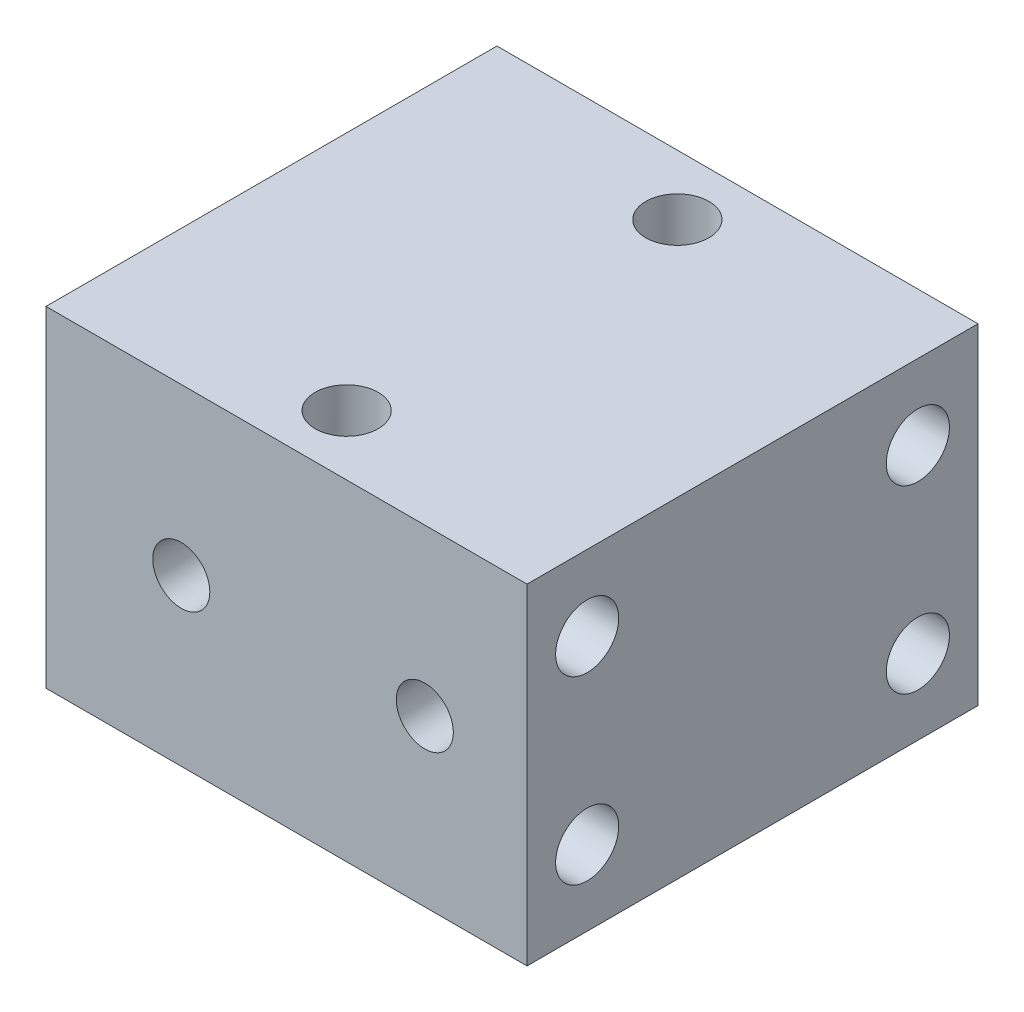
ISO-10303-21;
HEADER;
FILE_DESCRIPTION(('STEP AP214'),'2;1');
FILE_NAME('part.step','',(''),(''),'','','');
FILE_SCHEMA(('AUTOMOTIVE_DESIGN { 1 0 10303 214 1 1 1 1 }'));
ENDSEC;
DATA;
#1=APPLICATION_CONTEXT('core data for automotive mechanical design processes');
#2=APPLICATION_PROTOCOL_DEFINITION('international standard','automotive_design',2000,#1);
#3=PRODUCT_CONTEXT('',#1,'mechanical');
#4=PRODUCT('Part','Part','',(#3));
#5=PRODUCT_RELATED_PRODUCT_CATEGORY('part','',(#4));
#6=PRODUCT_DEFINITION_FORMATION('','',#4);
#7=PRODUCT_DEFINITION_CONTEXT('part definition',#1,'design');
#8=PRODUCT_DEFINITION('design','',#6,#7);
#9=PRODUCT_DEFINITION_SHAPE('','',#8);
#10=(LENGTH_UNIT() NAMED_UNIT(*) SI_UNIT(.MILLI.,.METRE.));
#11=(NAMED_UNIT(*) PLANE_ANGLE_UNIT() SI_UNIT($,.RADIAN.));
#12=(NAMED_UNIT(*) SI_UNIT($,.STERADIAN.) SOLID_ANGLE_UNIT());
#13=UNCERTAINTY_MEASURE_WITH_UNIT(LENGTH_MEASURE(1.E-05),#10,'distance_accuracy_value','');
#14=(GEOMETRIC_REPRESENTATION_CONTEXT(3) GLOBAL_UNCERTAINTY_ASSIGNED_CONTEXT((#13)) GLOBAL_UNIT_ASSIGNED_CONTEXT((#10,
#11,#12)) REPRESENTATION_CONTEXT('',''));
#15=CARTESIAN_POINT('',(0.,0.,0.));
#16=DIRECTION('',(0.,0.,1.));
#17=DIRECTION('',(1.,0.,0.));
#18=AXIS2_PLACEMENT_3D('',#15,#16,#17);
#19=CARTESIAN_POINT('',(0.,55.,27.5));
#20=DIRECTION('',(0.,-1.,0.));
#21=DIRECTION('',(0.,0.,-1.));
#22=AXIS2_PLACEMENT_3D('',#19,#20,#21);
#23=CYLINDRICAL_SURFACE('',#22,5.25);
#24=CARTESIAN_POINT('',(0.,12.5,27.5));
#25=DIRECTION('',(-0.707106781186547,-0.707106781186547,0.));
#26=DIRECTION('',(0.707106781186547,-0.707106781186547,0.));
#27=AXIS2_PLACEMENT_3D('',#24,#25,#26);
#28=ELLIPSE('',#27,7.42462120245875,5.25);
#29=CARTESIAN_POINT('',(0.,12.5,22.25));
#30=VERTEX_POINT('',#29);
#31=CARTESIAN_POINT('',(0.,12.5,32.75));
#32=VERTEX_POINT('',#31);
#33=EDGE_CURVE('E11',#30,#32,#28,.F.);
#34=ORIENTED_EDGE('',*,*,#33,.F.);
#35=CARTESIAN_POINT('',(0.,12.5,27.5));
#36=DIRECTION('',(0.707106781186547,-0.707106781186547,0.));
#37=DIRECTION('',(-0.707106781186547,-0.707106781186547,0.));
#38=AXIS2_PLACEMENT_3D('',#35,#36,#37);
#39=ELLIPSE('',#38,7.42462120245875,5.25);
#40=EDGE_CURVE('E49',#32,#30,#39,.F.);
#41=ORIENTED_EDGE('',*,*,#40,.F.);
#42=EDGE_LOOP('',(#34,#41));
#43=FACE_BOUND('',#42,.T.);
#44=CARTESIAN_POINT('',(0.,42.5,27.5));
#45=DIRECTION('',(-0.707106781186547,-0.707106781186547,0.));
#46=DIRECTION('',(0.707106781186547,-0.707106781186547,0.));
#47=AXIS2_PLACEMENT_3D('',#44,#45,#46);
#48=ELLIPSE('',#47,7.42462120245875,5.25);
#49=CARTESIAN_POINT('',(0.,42.5,22.25));
#50=VERTEX_POINT('',#49);
#51=CARTESIAN_POINT('',(0.,42.5,32.75));
#52=VERTEX_POINT('',#51);
#53=EDGE_CURVE('E250',#50,#52,#48,.T.);
#54=ORIENTED_EDGE('',*,*,#53,.F.);
#55=CARTESIAN_POINT('',(0.,42.5,27.5));
#56=DIRECTION('',(0.707106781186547,-0.707106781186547,0.));
#57=DIRECTION('',(-0.707106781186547,-0.707106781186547,0.));
#58=AXIS2_PLACEMENT_3D('',#55,#56,#57);
#59=ELLIPSE('',#58,7.42462120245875,5.25);
#60=EDGE_CURVE('E248',#52,#50,#59,.T.);
#61=ORIENTED_EDGE('',*,*,#60,.F.);
#62=EDGE_LOOP('',(#54,#61));
#63=FACE_BOUND('',#62,.T.);
#64=ADVANCED_FACE('F33',(#43,#63),#23,.F.);
#65=CARTESIAN_POINT('',(0.,42.5,27.5));
#66=DIRECTION('',(-0.707106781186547,-0.707106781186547,0.));
#67=DIRECTION('',(0.707106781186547,-0.707106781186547,0.));
#68=AXIS2_PLACEMENT_3D('',#65,#66,#67);
#69=ELLIPSE('',#68,7.42462120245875,5.25);
#70=EDGE_CURVE('E110',#50,#52,#69,.F.);
#71=ORIENTED_EDGE('',*,*,#70,.F.);
#72=CARTESIAN_POINT('',(0.,42.5,27.5));
#73=DIRECTION('',(0.707106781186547,-0.707106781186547,0.));
#74=DIRECTION('',(-0.707106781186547,-0.707106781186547,0.));
#75=AXIS2_PLACEMENT_3D('',#72,#73,#74);
#76=ELLIPSE('',#75,7.42462120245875,5.25);
#77=EDGE_CURVE('E56',#52,#50,#76,.F.);
#78=ORIENTED_EDGE('',*,*,#77,.F.);
#79=EDGE_LOOP('',(#71,#78));
#80=FACE_BOUND('',#79,.T.);
#81=CARTESIAN_POINT('',(0.,55.,27.5));
#82=DIRECTION('',(0.,1.,0.));
#83=DIRECTION('',(0.,0.,1.));
#84=AXIS2_PLACEMENT_3D('',#81,#82,#83);
#85=CIRCLE('',#84,5.25);
#86=CARTESIAN_POINT('',(0.,55.,32.75));
#87=VERTEX_POINT('',#86);
#88=EDGE_CURVE('E184',#87,#87,#85,.T.);
#89=ORIENTED_EDGE('',*,*,#88,.T.);
#90=EDGE_LOOP('',(#89));
#91=FACE_BOUND('',#90,.T.);
#92=ADVANCED_FACE('F305',(#80,#91),#23,.F.);
#93=CARTESIAN_POINT('',(0.,55.,-27.5));
#94=DIRECTION('',(0.,-1.,0.));
#95=DIRECTION('',(0.,0.,-1.));
#96=AXIS2_PLACEMENT_3D('',#93,#94,#95);
#97=CYLINDRICAL_SURFACE('',#96,5.25);
#98=CARTESIAN_POINT('',(0.,12.5,-27.5));
#99=DIRECTION('',(-0.707106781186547,-0.707106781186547,0.));
#100=DIRECTION('',(0.707106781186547,-0.707106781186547,0.));
#101=AXIS2_PLACEMENT_3D('',#98,#99,#100);
#102=ELLIPSE('',#101,7.42462120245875,5.25);
#103=CARTESIAN_POINT('',(0.,12.5,-32.75));
#104=VERTEX_POINT('',#103);
#105=CARTESIAN_POINT('',(0.,12.5,-22.25));
#106=VERTEX_POINT('',#105);
#107=EDGE_CURVE('E244',#104,#106,#102,.F.);
#108=ORIENTED_EDGE('',*,*,#107,.F.);
#109=CARTESIAN_POINT('',(0.,12.5,-27.5));
#110=DIRECTION('',(0.707106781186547,-0.707106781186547,0.));
#111=DIRECTION('',(-0.707106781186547,-0.707106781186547,0.));
#112=AXIS2_PLACEMENT_3D('',#109,#110,#111);
#113=ELLIPSE('',#112,7.42462120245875,5.25);
#114=EDGE_CURVE('E236',#106,#104,#113,.F.);
#115=ORIENTED_EDGE('',*,*,#114,.F.);
#116=EDGE_LOOP('',(#108,#115));
#117=FACE_BOUND('',#116,.T.);
#118=CARTESIAN_POINT('',(0.,42.5,-27.5));
#119=DIRECTION('',(-0.707106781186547,-0.707106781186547,0.));
#120=DIRECTION('',(0.707106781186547,-0.707106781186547,0.));
#121=AXIS2_PLACEMENT_3D('',#118,#119,#120);
#122=ELLIPSE('',#121,7.42462120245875,5.25);
#123=CARTESIAN_POINT('',(0.,42.5,-32.75));
#124=VERTEX_POINT('',#123);
#125=CARTESIAN_POINT('',(0.,42.5,-22.25));
#126=VERTEX_POINT('',#125);
#127=EDGE_CURVE('E230',#124,#126,#122,.T.);
#128=ORIENTED_EDGE('',*,*,#127,.F.);
#129=CARTESIAN_POINT('',(0.,42.5,-27.5));
#130=DIRECTION('',(0.707106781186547,-0.707106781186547,0.));
#131=DIRECTION('',(-0.707106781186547,-0.707106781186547,0.));
#132=AXIS2_PLACEMENT_3D('',#129,#130,#131);
#133=ELLIPSE('',#132,7.42462120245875,5.25);
#134=EDGE_CURVE('E228',#126,#124,#133,.T.);
#135=ORIENTED_EDGE('',*,*,#134,.F.);
#136=EDGE_LOOP('',(#128,#135));
#137=FACE_BOUND('',#136,.T.);
#138=ADVANCED_FACE('F310',(#117,#137),#97,.F.);
#139=CARTESIAN_POINT('',(0.,42.5,-27.5));
#140=DIRECTION('',(-0.707106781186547,-0.707106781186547,0.));
#141=DIRECTION('',(0.707106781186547,-0.707106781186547,0.));
#142=AXIS2_PLACEMENT_3D('',#139,#140,#141);
#143=ELLIPSE('',#142,7.42462120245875,5.25);
#144=EDGE_CURVE('E233',#124,#126,#143,.F.);
#145=ORIENTED_EDGE('',*,*,#144,.F.);
#146=CARTESIAN_POINT('',(0.,42.5,-27.5));
#147=DIRECTION('',(0.707106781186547,-0.707106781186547,0.));
#148=DIRECTION('',(-0.707106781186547,-0.707106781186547,0.));
#149=AXIS2_PLACEMENT_3D('',#146,#147,#148);
#150=ELLIPSE('',#149,7.42462120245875,5.25);
#151=EDGE_CURVE('E225',#126,#124,#150,.F.);
#152=ORIENTED_EDGE('',*,*,#151,.F.);
#153=EDGE_LOOP('',(#145,#152));
#154=FACE_BOUND('',#153,.T.);
#155=CARTESIAN_POINT('',(0.,55.,-27.5));
#156=DIRECTION('',(0.,1.,0.));
#157=DIRECTION('',(0.,0.,1.));
#158=AXIS2_PLACEMENT_3D('',#155,#156,#157);
#159=CIRCLE('',#158,5.25);
#160=CARTESIAN_POINT('',(0.,55.,-22.25));
#161=VERTEX_POINT('',#160);
#162=EDGE_CURVE('E190',#161,#161,#159,.T.);
#163=ORIENTED_EDGE('',*,*,#162,.T.);
#164=EDGE_LOOP('',(#163));
#165=FACE_BOUND('',#164,.T.);
#166=ADVANCED_FACE('F323',(#154,#165),#97,.F.);
#167=CARTESIAN_POINT('',(-40.,55.,37.5));
#168=DIRECTION('',(0.,1.,0.));
#169=DIRECTION('',(0.,0.,1.));
#170=AXIS2_PLACEMENT_3D('',#167,#168,#169);
#171=PLANE('',#170);
#172=ORIENTED_EDGE('',*,*,#162,.F.);
#173=EDGE_LOOP('',(#172));
#174=FACE_BOUND('',#173,.T.);
#175=DIRECTION('',(0.,0.,1.));
#176=VECTOR('',#175,1.);
#177=CARTESIAN_POINT('',(-40.,55.,-37.5));
#178=LINE('',#177,#176);
#179=CARTESIAN_POINT('',(-40.,55.,-37.5));
#180=VERTEX_POINT('',#179);
#181=CARTESIAN_POINT('',(-40.,55.,37.5));
#182=VERTEX_POINT('',#181);
#183=EDGE_CURVE('E196',#180,#182,#178,.T.);
#184=ORIENTED_EDGE('',*,*,#183,.T.);
#185=DIRECTION('',(1.,0.,0.));
#186=VECTOR('',#185,1.);
#187=CARTESIAN_POINT('',(-40.,55.,37.5));
#188=LINE('',#187,#186);
#189=CARTESIAN_POINT('',(40.,55.,37.5));
#190=VERTEX_POINT('',#189);
#191=EDGE_CURVE('E199',#182,#190,#188,.T.);
#192=ORIENTED_EDGE('',*,*,#191,.T.);
#193=DIRECTION('',(0.,0.,-1.));
#194=VECTOR('',#193,1.);
#195=CARTESIAN_POINT('',(40.,55.,-37.5));
#196=LINE('',#195,#194);
#197=CARTESIAN_POINT('',(40.,55.,-37.5));
#198=VERTEX_POINT('',#197);
#199=EDGE_CURVE('E202',#190,#198,#196,.T.);
#200=ORIENTED_EDGE('',*,*,#199,.T.);
#201=DIRECTION('',(-1.,0.,0.));
#202=VECTOR('',#201,1.);
#203=CARTESIAN_POINT('',(-40.,55.,-37.5));
#204=LINE('',#203,#202);
#205=EDGE_CURVE('E204',#198,#180,#204,.T.);
#206=ORIENTED_EDGE('',*,*,#205,.T.);
#207=EDGE_LOOP('',(#184,#192,#200,#206));
#208=FACE_BOUND('',#207,.T.);
#209=ORIENTED_EDGE('',*,*,#88,.F.);
#210=EDGE_LOOP('',(#209));
#211=FACE_BOUND('',#210,.T.);
#212=ADVANCED_FACE('F293',(#174,#208,#211),#171,.T.);
#213=CARTESIAN_POINT('',(-40.,0.,37.5));
#214=DIRECTION('',(0.,1.,0.));
#215=DIRECTION('',(0.,0.,1.));
#216=AXIS2_PLACEMENT_3D('',#213,#214,#215);
#217=PLANE('',#216);
#218=CARTESIAN_POINT('',(0.,0.,-27.5));
#219=DIRECTION('',(0.,1.,0.));
#220=DIRECTION('',(0.,0.,1.));
#221=AXIS2_PLACEMENT_3D('',#218,#219,#220);
#222=CIRCLE('',#221,5.25);
#223=CARTESIAN_POINT('',(0.,0.,-22.25));
#224=VERTEX_POINT('',#223);
#225=EDGE_CURVE('E187',#224,#224,#222,.T.);
#226=ORIENTED_EDGE('',*,*,#225,.T.);
#227=EDGE_LOOP('',(#226));
#228=FACE_BOUND('',#227,.T.);
#229=DIRECTION('',(0.,0.,1.));
#230=VECTOR('',#229,1.);
#231=CARTESIAN_POINT('',(-40.,0.,-37.5));
#232=LINE('',#231,#230);
#233=CARTESIAN_POINT('',(-40.,0.,-37.5));
#234=VERTEX_POINT('',#233);
#235=CARTESIAN_POINT('',(-40.,0.,37.5));
#236=VERTEX_POINT('',#235);
#237=EDGE_CURVE('E193',#234,#236,#232,.T.);
#238=ORIENTED_EDGE('',*,*,#237,.F.);
#239=DIRECTION('',(-1.,0.,0.));
#240=VECTOR('',#239,1.);
#241=CARTESIAN_POINT('',(-40.,0.,-37.5));
#242=LINE('',#241,#240);
#243=CARTESIAN_POINT('',(40.,0.,-37.5));
#244=VERTEX_POINT('',#243);
#245=EDGE_CURVE('E200',#244,#234,#242,.T.);
#246=ORIENTED_EDGE('',*,*,#245,.F.);
#247=DIRECTION('',(0.,0.,-1.));
#248=VECTOR('',#247,1.);
#249=CARTESIAN_POINT('',(40.,0.,-37.5));
#250=LINE('',#249,#248);
#251=CARTESIAN_POINT('',(40.,0.,37.5));
#252=VERTEX_POINT('',#251);
#253=EDGE_CURVE('E211',#252,#244,#250,.T.);
#254=ORIENTED_EDGE('',*,*,#253,.F.);
#255=DIRECTION('',(1.,0.,0.));
#256=VECTOR('',#255,1.);
#257=CARTESIAN_POINT('',(-40.,0.,37.5));
#258=LINE('',#257,#256);
#259=EDGE_CURVE('E209',#236,#252,#258,.T.);
#260=ORIENTED_EDGE('',*,*,#259,.F.);
#261=EDGE_LOOP('',(#238,#246,#254,#260));
#262=FACE_BOUND('',#261,.T.);
#263=CARTESIAN_POINT('',(0.,0.,27.5));
#264=DIRECTION('',(0.,1.,0.));
#265=DIRECTION('',(0.,0.,1.));
#266=AXIS2_PLACEMENT_3D('',#263,#264,#265);
#267=CIRCLE('',#266,5.25);
#268=CARTESIAN_POINT('',(0.,0.,32.75));
#269=VERTEX_POINT('',#268);
#270=EDGE_CURVE('E181',#269,#269,#267,.T.);
#271=ORIENTED_EDGE('',*,*,#270,.T.);
#272=EDGE_LOOP('',(#271));
#273=FACE_BOUND('',#272,.T.);
#274=ADVANCED_FACE('F287',(#228,#262,#273),#217,.F.);
#275=CARTESIAN_POINT('',(-40.,55.,-37.5));
#276=DIRECTION('',(1.,0.,0.));
#277=DIRECTION('',(0.,0.,-1.));
#278=AXIS2_PLACEMENT_3D('',#275,#276,#277);
#279=PLANE('',#278);
#280=CARTESIAN_POINT('',(-40.,12.5,27.5));
#281=DIRECTION('',(-1.,0.,0.));
#282=DIRECTION('',(0.,0.,1.));
#283=AXIS2_PLACEMENT_3D('',#280,#281,#282);
#284=CIRCLE('',#283,5.25);
#285=CARTESIAN_POINT('',(-40.,12.5,32.75));
#286=VERTEX_POINT('',#285);
#287=EDGE_CURVE('E118',#286,#286,#284,.T.);
#288=ORIENTED_EDGE('',*,*,#287,.F.);
#289=EDGE_LOOP('',(#288));
#290=FACE_BOUND('',#289,.T.);
#291=CARTESIAN_POINT('',(-40.,42.5,27.5));
#292=DIRECTION('',(-1.,0.,0.));
#293=DIRECTION('',(0.,0.,1.));
#294=AXIS2_PLACEMENT_3D('',#291,#292,#293);
#295=CIRCLE('',#294,5.25);
#296=CARTESIAN_POINT('',(-40.,42.5,32.75));
#297=VERTEX_POINT('',#296);
#298=EDGE_CURVE('E135',#297,#297,#295,.T.);
#299=ORIENTED_EDGE('',*,*,#298,.F.);
#300=EDGE_LOOP('',(#299));
#301=FACE_BOUND('',#300,.T.);
#302=CARTESIAN_POINT('',(-40.,12.5,-27.5));
#303=DIRECTION('',(-1.,0.,0.));
#304=DIRECTION('',(0.,0.,1.));
#305=AXIS2_PLACEMENT_3D('',#302,#303,#304);
#306=CIRCLE('',#305,5.25);
#307=CARTESIAN_POINT('',(-40.,12.5,-22.25));
#308=VERTEX_POINT('',#307);
#309=EDGE_CURVE('E141',#308,#308,#306,.T.);
#310=ORIENTED_EDGE('',*,*,#309,.F.);
#311=EDGE_LOOP('',(#310));
#312=FACE_BOUND('',#311,.T.);
#313=CARTESIAN_POINT('',(-40.,42.5,-27.5));
#314=DIRECTION('',(-1.,0.,0.));
#315=DIRECTION('',(0.,0.,1.));
#316=AXIS2_PLACEMENT_3D('',#313,#314,#315);
#317=CIRCLE('',#316,5.25);
#318=CARTESIAN_POINT('',(-40.,42.5,-22.25));
#319=VERTEX_POINT('',#318);
#320=EDGE_CURVE('E147',#319,#319,#317,.T.);
#321=ORIENTED_EDGE('',*,*,#320,.F.);
#322=EDGE_LOOP('',(#321));
#323=FACE_BOUND('',#322,.T.);
#324=CARTESIAN_POINT('',(-40.,27.5,0.));
#325=DIRECTION('',(-1.,0.,0.));
#326=DIRECTION('',(0.,0.,1.));
#327=AXIS2_PLACEMENT_3D('',#324,#325,#326);
#328=CIRCLE('',#327,0.5);
#329=CARTESIAN_POINT('',(-40.,27.5,0.5));
#330=VERTEX_POINT('',#329);
#331=EDGE_CURVE('E177',#330,#330,#328,.T.);
#332=ORIENTED_EDGE('',*,*,#331,.F.);
#333=EDGE_LOOP('',(#332));
#334=FACE_BOUND('',#333,.T.);
#335=ORIENTED_EDGE('',*,*,#237,.T.);
#336=DIRECTION('',(0.,-1.,0.));
#337=VECTOR('',#336,1.);
#338=CARTESIAN_POINT('',(-40.,55.,37.5));
#339=LINE('',#338,#337);
#340=EDGE_CURVE('E222',#182,#236,#339,.T.);
#341=ORIENTED_EDGE('',*,*,#340,.F.);
#342=ORIENTED_EDGE('',*,*,#183,.F.);
#343=DIRECTION('',(0.,-1.,0.));
#344=VECTOR('',#343,1.);
#345=CARTESIAN_POINT('',(-40.,55.,-37.5));
#346=LINE('',#345,#344);
#347=EDGE_CURVE('E206',#180,#234,#346,.T.);
#348=ORIENTED_EDGE('',*,*,#347,.T.);
#349=EDGE_LOOP('',(#335,#341,#342,#348));
#350=FACE_BOUND('',#349,.T.);
#351=ADVANCED_FACE('F35',(#290,#301,#312,#323,#334,#350),#279,.F.);
#352=CARTESIAN_POINT('',(-40.,55.,37.5));
#353=DIRECTION('',(0.,0.,-1.));
#354=DIRECTION('',(-1.,0.,0.));
#355=AXIS2_PLACEMENT_3D('',#352,#353,#354);
#356=PLANE('',#355);
#357=CARTESIAN_POINT('',(23.,27.5,37.5));
#358=DIRECTION('',(0.,0.,1.));
#359=DIRECTION('',(1.,0.,0.));
#360=AXIS2_PLACEMENT_3D('',#357,#358,#359);
#361=CIRCLE('',#360,4.744593);
#362=CARTESIAN_POINT('',(27.744593,27.5,37.5));
#363=VERTEX_POINT('',#362);
#364=EDGE_CURVE('E153',#363,#363,#361,.T.);
#365=ORIENTED_EDGE('',*,*,#364,.F.);
#366=EDGE_LOOP('',(#365));
#367=FACE_BOUND('',#366,.T.);
#368=CARTESIAN_POINT('',(-17.5,27.5,37.5));
#369=DIRECTION('',(0.,0.,1.));
#370=DIRECTION('',(1.,0.,0.));
#371=AXIS2_PLACEMENT_3D('',#368,#369,#370);
#372=CIRCLE('',#371,4.744593);
#373=CARTESIAN_POINT('',(-12.755407,27.5,37.5));
#374=VERTEX_POINT('',#373);
#375=EDGE_CURVE('E165',#374,#374,#372,.T.);
#376=ORIENTED_EDGE('',*,*,#375,.F.);
#377=EDGE_LOOP('',(#376));
#378=FACE_BOUND('',#377,.T.);
#379=ORIENTED_EDGE('',*,*,#259,.T.);
#380=DIRECTION('',(0.,-1.,0.));
#381=VECTOR('',#380,1.);
#382=CARTESIAN_POINT('',(40.,55.,37.5));
#383=LINE('',#382,#381);
#384=EDGE_CURVE('E219',#190,#252,#383,.T.);
#385=ORIENTED_EDGE('',*,*,#384,.F.);
#386=ORIENTED_EDGE('',*,*,#191,.F.);
#387=ORIENTED_EDGE('',*,*,#340,.T.);
#388=EDGE_LOOP('',(#379,#385,#386,#387));
#389=FACE_BOUND('',#388,.T.);
#390=ADVANCED_FACE('F270',(#367,#378,#389),#356,.F.);
#391=CARTESIAN_POINT('',(40.,55.,-37.5));
#392=DIRECTION('',(-1.,0.,0.));
#393=DIRECTION('',(0.,0.,1.));
#394=AXIS2_PLACEMENT_3D('',#391,#392,#393);
#395=PLANE('',#394);
#396=CARTESIAN_POINT('',(40.,12.5,27.5));
#397=DIRECTION('',(-1.,0.,0.));
#398=DIRECTION('',(0.,0.,1.));
#399=AXIS2_PLACEMENT_3D('',#396,#397,#398);
#400=CIRCLE('',#399,5.25);
#401=CARTESIAN_POINT('',(40.,12.5,32.75));
#402=VERTEX_POINT('',#401);
#403=EDGE_CURVE('E123',#402,#402,#400,.F.);
#404=ORIENTED_EDGE('',*,*,#403,.F.);
#405=EDGE_LOOP('',(#404));
#406=FACE_BOUND('',#405,.T.);
#407=CARTESIAN_POINT('',(40.,42.5,27.5));
#408=DIRECTION('',(-1.,0.,0.));
#409=DIRECTION('',(0.,0.,1.));
#410=AXIS2_PLACEMENT_3D('',#407,#408,#409);
#411=CIRCLE('',#410,5.25);
#412=CARTESIAN_POINT('',(40.,42.5,32.75));
#413=VERTEX_POINT('',#412);
#414=EDGE_CURVE('E138',#413,#413,#411,.F.);
#415=ORIENTED_EDGE('',*,*,#414,.F.);
#416=EDGE_LOOP('',(#415));
#417=FACE_BOUND('',#416,.T.);
#418=CARTESIAN_POINT('',(40.,12.5,-27.5));
#419=DIRECTION('',(-1.,0.,0.));
#420=DIRECTION('',(0.,0.,1.));
#421=AXIS2_PLACEMENT_3D('',#418,#419,#420);
#422=CIRCLE('',#421,5.25);
#423=CARTESIAN_POINT('',(40.,12.5,-22.25));
#424=VERTEX_POINT('',#423);
#425=EDGE_CURVE('E144',#424,#424,#422,.F.);
#426=ORIENTED_EDGE('',*,*,#425,.F.);
#427=EDGE_LOOP('',(#426));
#428=FACE_BOUND('',#427,.T.);
#429=CARTESIAN_POINT('',(40.,42.5,-27.5));
#430=DIRECTION('',(-1.,0.,0.));
#431=DIRECTION('',(0.,0.,1.));
#432=AXIS2_PLACEMENT_3D('',#429,#430,#431);
#433=CIRCLE('',#432,5.25);
#434=CARTESIAN_POINT('',(40.,42.5,-22.25));
#435=VERTEX_POINT('',#434);
#436=EDGE_CURVE('E150',#435,#435,#433,.F.);
#437=ORIENTED_EDGE('',*,*,#436,.F.);
#438=EDGE_LOOP('',(#437));
#439=FACE_BOUND('',#438,.T.);
#440=ORIENTED_EDGE('',*,*,#253,.T.);
#441=DIRECTION('',(0.,-1.,0.));
#442=VECTOR('',#441,1.);
#443=CARTESIAN_POINT('',(40.,55.,-37.5));
#444=LINE('',#443,#442);
#445=EDGE_CURVE('E216',#198,#244,#444,.T.);
#446=ORIENTED_EDGE('',*,*,#445,.F.);
#447=ORIENTED_EDGE('',*,*,#199,.F.);
#448=ORIENTED_EDGE('',*,*,#384,.T.);
#449=EDGE_LOOP('',(#440,#446,#447,#448));
#450=FACE_BOUND('',#449,.T.);
#451=ADVANCED_FACE('F266',(#406,#417,#428,#439,#450),#395,.F.);
#452=CARTESIAN_POINT('',(-40.,55.,-37.5));
#453=DIRECTION('',(0.,0.,1.));
#454=DIRECTION('',(1.,0.,0.));
#455=AXIS2_PLACEMENT_3D('',#452,#453,#454);
#456=PLANE('',#455);
#457=ORIENTED_EDGE('',*,*,#245,.T.);
#458=ORIENTED_EDGE('',*,*,#347,.F.);
#459=ORIENTED_EDGE('',*,*,#205,.F.);
#460=ORIENTED_EDGE('',*,*,#445,.T.);
#461=EDGE_LOOP('',(#457,#458,#459,#460));
#462=FACE_BOUND('',#461,.T.);
#463=ADVANCED_FACE('F269',(#462),#456,.F.);
#464=CARTESIAN_POINT('',(0.,12.5,-27.5));
#465=DIRECTION('',(-0.707106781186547,-0.707106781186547,0.));
#466=DIRECTION('',(0.707106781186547,-0.707106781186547,0.));
#467=AXIS2_PLACEMENT_3D('',#464,#465,#466);
#468=ELLIPSE('',#467,7.42462120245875,5.25);
#469=EDGE_CURVE('E241',#104,#106,#468,.T.);
#470=ORIENTED_EDGE('',*,*,#469,.F.);
#471=CARTESIAN_POINT('',(0.,12.5,-27.5));
#472=DIRECTION('',(0.707106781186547,-0.707106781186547,0.));
#473=DIRECTION('',(-0.707106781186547,-0.707106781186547,0.));
#474=AXIS2_PLACEMENT_3D('',#471,#472,#473);
#475=ELLIPSE('',#474,7.42462120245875,5.25);
#476=EDGE_CURVE('E239',#106,#104,#475,.T.);
#477=ORIENTED_EDGE('',*,*,#476,.F.);
#478=EDGE_LOOP('',(#470,#477));
#479=FACE_BOUND('',#478,.T.);
#480=ORIENTED_EDGE('',*,*,#225,.F.);
#481=EDGE_LOOP('',(#480));
#482=FACE_BOUND('',#481,.T.);
#483=ADVANCED_FACE('F315',(#479,#482),#97,.F.);
#484=CARTESIAN_POINT('',(0.,12.5,27.5));
#485=DIRECTION('',(-0.707106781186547,-0.707106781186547,0.));
#486=DIRECTION('',(0.707106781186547,-0.707106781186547,0.));
#487=AXIS2_PLACEMENT_3D('',#484,#485,#486);
#488=ELLIPSE('',#487,7.42462120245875,5.25);
#489=EDGE_CURVE('E42',#30,#32,#488,.T.);
#490=ORIENTED_EDGE('',*,*,#489,.F.);
#491=CARTESIAN_POINT('',(0.,12.5,27.5));
#492=DIRECTION('',(0.707106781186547,-0.707106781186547,0.));
#493=DIRECTION('',(-0.707106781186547,-0.707106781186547,0.));
#494=AXIS2_PLACEMENT_3D('',#491,#492,#493);
#495=ELLIPSE('',#494,7.42462120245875,5.25);
#496=EDGE_CURVE('E101',#32,#30,#495,.T.);
#497=ORIENTED_EDGE('',*,*,#496,.F.);
#498=EDGE_LOOP('',(#490,#497));
#499=FACE_BOUND('',#498,.T.);
#500=ORIENTED_EDGE('',*,*,#270,.F.);
#501=EDGE_LOOP('',(#500));
#502=FACE_BOUND('',#501,.T.);
#503=ADVANCED_FACE('F113',(#499,#502),#23,.F.);
#504=CARTESIAN_POINT('',(20.,27.5,0.));
#505=DIRECTION('',(-1.,0.,0.));
#506=DIRECTION('',(0.,0.,1.));
#507=AXIS2_PLACEMENT_3D('',#504,#505,#506);
#508=CYLINDRICAL_SURFACE('',#507,0.5);
#509=CARTESIAN_POINT('',(20.,27.5,0.));
#510=DIRECTION('',(-1.,0.,0.));
#511=DIRECTION('',(0.,0.,1.));
#512=AXIS2_PLACEMENT_3D('',#509,#510,#511);
#513=CIRCLE('',#512,0.5);
#514=CARTESIAN_POINT('',(20.,27.5,0.499999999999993));
#515=VERTEX_POINT('',#514);
#516=EDGE_CURVE('E178',#515,#515,#513,.T.);
#517=ORIENTED_EDGE('',*,*,#516,.F.);
#518=EDGE_LOOP('',(#517));
#519=FACE_BOUND('',#518,.T.);
#520=ORIENTED_EDGE('',*,*,#331,.T.);
#521=EDGE_LOOP('',(#520));
#522=FACE_BOUND('',#521,.T.);
#523=ADVANCED_FACE('F314',(#519,#522),#508,.F.);
#524=CARTESIAN_POINT('',(20.,27.5,0.));
#525=DIRECTION('',(-1.,0.,0.));
#526=DIRECTION('',(0.,0.,1.));
#527=AXIS2_PLACEMENT_3D('',#524,#525,#526);
#528=PLANE('',#527);
#529=ORIENTED_EDGE('',*,*,#516,.T.);
#530=EDGE_LOOP('',(#529));
#531=FACE_BOUND('',#530,.T.);
#532=ADVANCED_FACE('F320',(#531),#528,.T.);
#533=CARTESIAN_POINT('',(-17.5,27.5,25.88));
#534=DIRECTION('',(0.,0.,1.));
#535=DIRECTION('',(1.,0.,0.));
#536=AXIS2_PLACEMENT_3D('',#533,#534,#535);
#537=CONICAL_SURFACE('',#536,4.21640000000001,1.02974425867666);
#538=CARTESIAN_POINT('',(-17.5,27.5,24.5482525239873));
#539=DIRECTION('',(0.,0.,1.));
#540=DIRECTION('',(1.,0.,0.));
#541=AXIS2_PLACEMENT_3D('',#538,#539,#540);
#542=CIRCLE('',#541,2.00000000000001);
#543=CARTESIAN_POINT('',(-15.5,27.5,24.5482525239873));
#544=VERTEX_POINT('',#543);
#545=EDGE_CURVE('E116',#544,#544,#542,.F.);
#546=ORIENTED_EDGE('',*,*,#545,.T.);
#547=EDGE_LOOP('',(#546));
#548=FACE_BOUND('',#547,.T.);
#549=CARTESIAN_POINT('',(-17.5,27.5,25.88));
#550=DIRECTION('',(0.,0.,1.));
#551=DIRECTION('',(1.,0.,0.));
#552=AXIS2_PLACEMENT_3D('',#549,#550,#551);
#553=CIRCLE('',#552,4.21640000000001);
#554=CARTESIAN_POINT('',(-13.2836,27.5,25.88));
#555=VERTEX_POINT('',#554);
#556=EDGE_CURVE('E174',#555,#555,#553,.T.);
#557=ORIENTED_EDGE('',*,*,#556,.T.);
#558=EDGE_LOOP('',(#557));
#559=FACE_BOUND('',#558,.T.);
#560=ADVANCED_FACE('F385',(#548,#559),#537,.F.);
#561=CARTESIAN_POINT('',(-17.5,27.5,37.5));
#562=DIRECTION('',(0.,0.,1.));
#563=DIRECTION('',(1.,0.,0.));
#564=AXIS2_PLACEMENT_3D('',#561,#562,#563);
#565=CYLINDRICAL_SURFACE('',#564,4.21640000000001);
#566=ORIENTED_EDGE('',*,*,#556,.F.);
#567=EDGE_LOOP('',(#566));
#568=FACE_BOUND('',#567,.T.);
#569=CARTESIAN_POINT('',(-17.5,27.5,30.58));
#570=DIRECTION('',(0.,0.,1.));
#571=DIRECTION('',(1.,0.,0.));
#572=AXIS2_PLACEMENT_3D('',#569,#570,#571);
#573=CIRCLE('',#572,4.2164);
#574=CARTESIAN_POINT('',(-13.2836,27.5,30.58));
#575=VERTEX_POINT('',#574);
#576=EDGE_CURVE('E171',#575,#575,#573,.T.);
#577=ORIENTED_EDGE('',*,*,#576,.T.);
#578=EDGE_LOOP('',(#577));
#579=FACE_BOUND('',#578,.T.);
#580=ADVANCED_FACE('F381',(#568,#579),#565,.F.);
#581=CARTESIAN_POINT('',(-13.2836,27.5,30.58));
#582=DIRECTION('',(0.,0.,-1.));
#583=DIRECTION('',(-1.,0.,0.));
#584=AXIS2_PLACEMENT_3D('',#581,#582,#583);
#585=PLANE('',#584);
#586=ORIENTED_EDGE('',*,*,#576,.F.);
#587=EDGE_LOOP('',(#586));
#588=FACE_BOUND('',#587,.T.);
#589=CARTESIAN_POINT('',(-17.5,27.5,30.58));
#590=DIRECTION('',(0.,0.,1.));
#591=DIRECTION('',(1.,0.,0.));
#592=AXIS2_PLACEMENT_3D('',#589,#590,#591);
#593=CIRCLE('',#592,4.53739893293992);
#594=CARTESIAN_POINT('',(-12.9626010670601,27.5,30.58));
#595=VERTEX_POINT('',#594);
#596=EDGE_CURVE('E168',#595,#595,#593,.T.);
#597=ORIENTED_EDGE('',*,*,#596,.T.);
#598=EDGE_LOOP('',(#597));
#599=FACE_BOUND('',#598,.T.);
#600=ADVANCED_FACE('F377',(#588,#599),#585,.F.);
#601=CARTESIAN_POINT('',(-17.5,27.5,37.5));
#602=DIRECTION('',(0.,0.,1.));
#603=DIRECTION('',(1.,0.,0.));
#604=AXIS2_PLACEMENT_3D('',#601,#602,#603);
#605=CONICAL_SURFACE('',#604,4.744593,0.0299323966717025);
#606=ORIENTED_EDGE('',*,*,#596,.F.);
#607=EDGE_LOOP('',(#606));
#608=FACE_BOUND('',#607,.T.);
#609=ORIENTED_EDGE('',*,*,#375,.T.);
#610=EDGE_LOOP('',(#609));
#611=FACE_BOUND('',#610,.T.);
#612=ADVANCED_FACE('F373',(#608,#611),#605,.F.);
#613=CARTESIAN_POINT('',(23.,27.5,25.88));
#614=DIRECTION('',(0.,0.,1.));
#615=DIRECTION('',(1.,0.,0.));
#616=AXIS2_PLACEMENT_3D('',#613,#614,#615);
#617=CONICAL_SURFACE('',#616,4.21640000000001,1.02974425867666);
#618=CARTESIAN_POINT('',(23.,27.5,24.5482525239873));
#619=DIRECTION('',(0.,0.,1.));
#620=DIRECTION('',(1.,0.,0.));
#621=AXIS2_PLACEMENT_3D('',#618,#619,#620);
#622=CIRCLE('',#621,2.);
#623=CARTESIAN_POINT('',(25.,27.5,24.5482525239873));
#624=VERTEX_POINT('',#623);
#625=EDGE_CURVE('E37',#624,#624,#622,.F.);
#626=ORIENTED_EDGE('',*,*,#625,.T.);
#627=EDGE_LOOP('',(#626));
#628=FACE_BOUND('',#627,.T.);
#629=CARTESIAN_POINT('',(23.,27.5,25.88));
#630=DIRECTION('',(0.,0.,1.));
#631=DIRECTION('',(1.,0.,0.));
#632=AXIS2_PLACEMENT_3D('',#629,#630,#631);
#633=CIRCLE('',#632,4.21640000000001);
#634=CARTESIAN_POINT('',(27.2164,27.5,25.88));
#635=VERTEX_POINT('',#634);
#636=EDGE_CURVE('E162',#635,#635,#633,.T.);
#637=ORIENTED_EDGE('',*,*,#636,.T.);
#638=EDGE_LOOP('',(#637));
#639=FACE_BOUND('',#638,.T.);
#640=ADVANCED_FACE('F369',(#628,#639),#617,.F.);
#641=CARTESIAN_POINT('',(23.,27.5,37.5));
#642=DIRECTION('',(0.,0.,1.));
#643=DIRECTION('',(1.,0.,0.));
#644=AXIS2_PLACEMENT_3D('',#641,#642,#643);
#645=CYLINDRICAL_SURFACE('',#644,4.21640000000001);
#646=ORIENTED_EDGE('',*,*,#636,.F.);
#647=EDGE_LOOP('',(#646));
#648=FACE_BOUND('',#647,.T.);
#649=CARTESIAN_POINT('',(23.,27.5,30.58));
#650=DIRECTION('',(0.,0.,1.));
#651=DIRECTION('',(1.,0.,0.));
#652=AXIS2_PLACEMENT_3D('',#649,#650,#651);
#653=CIRCLE('',#652,4.2164);
#654=CARTESIAN_POINT('',(27.2164,27.5,30.58));
#655=VERTEX_POINT('',#654);
#656=EDGE_CURVE('E159',#655,#655,#653,.T.);
#657=ORIENTED_EDGE('',*,*,#656,.T.);
#658=EDGE_LOOP('',(#657));
#659=FACE_BOUND('',#658,.T.);
#660=ADVANCED_FACE('F365',(#648,#659),#645,.F.);
#661=CARTESIAN_POINT('',(27.2164,27.5,30.58));
#662=DIRECTION('',(0.,0.,-1.));
#663=DIRECTION('',(-1.,0.,0.));
#664=AXIS2_PLACEMENT_3D('',#661,#662,#663);
#665=PLANE('',#664);
#666=ORIENTED_EDGE('',*,*,#656,.F.);
#667=EDGE_LOOP('',(#666));
#668=FACE_BOUND('',#667,.T.);
#669=CARTESIAN_POINT('',(23.,27.5,30.58));
#670=DIRECTION('',(0.,0.,1.));
#671=DIRECTION('',(1.,0.,0.));
#672=AXIS2_PLACEMENT_3D('',#669,#670,#671);
#673=CIRCLE('',#672,4.53739893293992);
#674=CARTESIAN_POINT('',(27.5373989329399,27.5,30.58));
#675=VERTEX_POINT('',#674);
#676=EDGE_CURVE('E156',#675,#675,#673,.T.);
#677=ORIENTED_EDGE('',*,*,#676,.T.);
#678=EDGE_LOOP('',(#677));
#679=FACE_BOUND('',#678,.T.);
#680=ADVANCED_FACE('F358',(#668,#679),#665,.F.);
#681=CARTESIAN_POINT('',(23.,27.5,37.5));
#682=DIRECTION('',(0.,0.,1.));
#683=DIRECTION('',(1.,0.,0.));
#684=AXIS2_PLACEMENT_3D('',#681,#682,#683);
#685=CONICAL_SURFACE('',#684,4.744593,0.0299323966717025);
#686=ORIENTED_EDGE('',*,*,#676,.F.);
#687=EDGE_LOOP('',(#686));
#688=FACE_BOUND('',#687,.T.);
#689=ORIENTED_EDGE('',*,*,#364,.T.);
#690=EDGE_LOOP('',(#689));
#691=FACE_BOUND('',#690,.T.);
#692=ADVANCED_FACE('F351',(#688,#691),#685,.F.);
#693=CARTESIAN_POINT('',(54.8492424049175,42.5,-27.5));
#694=DIRECTION('',(-1.,0.,0.));
#695=DIRECTION('',(0.,0.,1.));
#696=AXIS2_PLACEMENT_3D('',#693,#694,#695);
#697=CYLINDRICAL_SURFACE('',#696,5.25);
#698=ORIENTED_EDGE('',*,*,#127,.T.);
#699=ORIENTED_EDGE('',*,*,#151,.T.);
#700=EDGE_LOOP('',(#698,#699));
#701=FACE_BOUND('',#700,.T.);
#702=ORIENTED_EDGE('',*,*,#436,.T.);
#703=EDGE_LOOP('',(#702));
#704=FACE_BOUND('',#703,.T.);
#705=ADVANCED_FACE('F347',(#701,#704),#697,.F.);
#706=ORIENTED_EDGE('',*,*,#144,.T.);
#707=ORIENTED_EDGE('',*,*,#134,.T.);
#708=EDGE_LOOP('',(#706,#707));
#709=FACE_BOUND('',#708,.T.);
#710=ORIENTED_EDGE('',*,*,#320,.T.);
#711=EDGE_LOOP('',(#710));
#712=FACE_BOUND('',#711,.T.);
#713=ADVANCED_FACE('F350',(#709,#712),#697,.F.);
#714=CARTESIAN_POINT('',(54.8492424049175,12.5,-27.5));
#715=DIRECTION('',(-1.,0.,0.));
#716=DIRECTION('',(0.,0.,1.));
#717=AXIS2_PLACEMENT_3D('',#714,#715,#716);
#718=CYLINDRICAL_SURFACE('',#717,5.25);
#719=ORIENTED_EDGE('',*,*,#469,.T.);
#720=ORIENTED_EDGE('',*,*,#114,.T.);
#721=EDGE_LOOP('',(#719,#720));
#722=FACE_BOUND('',#721,.T.);
#723=ORIENTED_EDGE('',*,*,#425,.T.);
#724=EDGE_LOOP('',(#723));
#725=FACE_BOUND('',#724,.T.);
#726=ADVANCED_FACE('F357',(#722,#725),#718,.F.);
#727=ORIENTED_EDGE('',*,*,#107,.T.);
#728=ORIENTED_EDGE('',*,*,#476,.T.);
#729=EDGE_LOOP('',(#727,#728));
#730=FACE_BOUND('',#729,.T.);
#731=ORIENTED_EDGE('',*,*,#309,.T.);
#732=EDGE_LOOP('',(#731));
#733=FACE_BOUND('',#732,.T.);
#734=ADVANCED_FACE('F262',(#730,#733),#718,.F.);
#735=CARTESIAN_POINT('',(54.8492424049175,42.5,27.5));
#736=DIRECTION('',(-1.,0.,0.));
#737=DIRECTION('',(0.,0.,1.));
#738=AXIS2_PLACEMENT_3D('',#735,#736,#737);
#739=CYLINDRICAL_SURFACE('',#738,5.25);
#740=ORIENTED_EDGE('',*,*,#53,.T.);
#741=ORIENTED_EDGE('',*,*,#77,.T.);
#742=EDGE_LOOP('',(#740,#741));
#743=FACE_BOUND('',#742,.T.);
#744=ORIENTED_EDGE('',*,*,#414,.T.);
#745=EDGE_LOOP('',(#744));
#746=FACE_BOUND('',#745,.T.);
#747=ADVANCED_FACE('F259',(#743,#746),#739,.F.);
#748=ORIENTED_EDGE('',*,*,#70,.T.);
#749=ORIENTED_EDGE('',*,*,#60,.T.);
#750=EDGE_LOOP('',(#748,#749));
#751=FACE_BOUND('',#750,.T.);
#752=ORIENTED_EDGE('',*,*,#298,.T.);
#753=EDGE_LOOP('',(#752));
#754=FACE_BOUND('',#753,.T.);
#755=ADVANCED_FACE('F255',(#751,#754),#739,.F.);
#756=CARTESIAN_POINT('',(54.8492424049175,12.5,27.5));
#757=DIRECTION('',(-1.,0.,0.));
#758=DIRECTION('',(0.,0.,1.));
#759=AXIS2_PLACEMENT_3D('',#756,#757,#758);
#760=CYLINDRICAL_SURFACE('',#759,5.25);
#761=ORIENTED_EDGE('',*,*,#489,.T.);
#762=ORIENTED_EDGE('',*,*,#40,.T.);
#763=EDGE_LOOP('',(#761,#762));
#764=FACE_BOUND('',#763,.T.);
#765=ORIENTED_EDGE('',*,*,#403,.T.);
#766=EDGE_LOOP('',(#765));
#767=FACE_BOUND('',#766,.T.);
#768=ADVANCED_FACE('F108',(#764,#767),#760,.F.);
#769=ORIENTED_EDGE('',*,*,#33,.T.);
#770=ORIENTED_EDGE('',*,*,#496,.T.);
#771=EDGE_LOOP('',(#769,#770));
#772=FACE_BOUND('',#771,.T.);
#773=ORIENTED_EDGE('',*,*,#287,.T.);
#774=EDGE_LOOP('',(#773));
#775=FACE_BOUND('',#774,.T.);
#776=ADVANCED_FACE('F102',(#772,#775),#760,.F.);
#777=CARTESIAN_POINT('',(-17.5,27.5,17.5));
#778=DIRECTION('',(0.,0.,1.));
#779=DIRECTION('',(1.,0.,0.));
#780=AXIS2_PLACEMENT_3D('',#777,#778,#779);
#781=CYLINDRICAL_SURFACE('',#780,2.00000000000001);
#782=CARTESIAN_POINT('',(-17.5,27.5,17.5));
#783=DIRECTION('',(0.,0.,1.));
#784=DIRECTION('',(1.,0.,0.));
#785=AXIS2_PLACEMENT_3D('',#782,#783,#784);
#786=CIRCLE('',#785,2.00000000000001);
#787=CARTESIAN_POINT('',(-15.5,27.5,17.5));
#788=VERTEX_POINT('',#787);
#789=EDGE_CURVE('E119',#788,#788,#786,.T.);
#790=ORIENTED_EDGE('',*,*,#789,.F.);
#791=EDGE_LOOP('',(#790));
#792=FACE_BOUND('',#791,.T.);
#793=ORIENTED_EDGE('',*,*,#545,.F.);
#794=EDGE_LOOP('',(#793));
#795=FACE_BOUND('',#794,.T.);
#796=ADVANCED_FACE('F537',(#792,#795),#781,.F.);
#797=CARTESIAN_POINT('',(-17.5,27.5,17.5));
#798=DIRECTION('',(0.,0.,1.));
#799=DIRECTION('',(1.,0.,0.));
#800=AXIS2_PLACEMENT_3D('',#797,#798,#799);
#801=PLANE('',#800);
#802=ORIENTED_EDGE('',*,*,#789,.T.);
#803=EDGE_LOOP('',(#802));
#804=FACE_BOUND('',#803,.T.);
#805=ADVANCED_FACE('F558',(#804),#801,.T.);
#806=CARTESIAN_POINT('',(23.,27.5,17.5));
#807=DIRECTION('',(0.,0.,1.));
#808=DIRECTION('',(1.,0.,0.));
#809=AXIS2_PLACEMENT_3D('',#806,#807,#808);
#810=CYLINDRICAL_SURFACE('',#809,2.);
#811=CARTESIAN_POINT('',(23.,27.5,17.5));
#812=DIRECTION('',(0.,0.,1.));
#813=DIRECTION('',(1.,0.,0.));
#814=AXIS2_PLACEMENT_3D('',#811,#812,#813);
#815=CIRCLE('',#814,2.);
#816=CARTESIAN_POINT('',(25.,27.5,17.5));
#817=VERTEX_POINT('',#816);
#818=EDGE_CURVE('E130',#817,#817,#815,.T.);
#819=ORIENTED_EDGE('',*,*,#818,.F.);
#820=EDGE_LOOP('',(#819));
#821=FACE_BOUND('',#820,.T.);
#822=ORIENTED_EDGE('',*,*,#625,.F.);
#823=EDGE_LOOP('',(#822));
#824=FACE_BOUND('',#823,.T.);
#825=ADVANCED_FACE('F569',(#821,#824),#810,.F.);
#826=CARTESIAN_POINT('',(23.,27.5,17.5));
#827=DIRECTION('',(0.,0.,1.));
#828=DIRECTION('',(1.,0.,0.));
#829=AXIS2_PLACEMENT_3D('',#826,#827,#828);
#830=PLANE('',#829);
#831=ORIENTED_EDGE('',*,*,#818,.T.);
#832=EDGE_LOOP('',(#831));
#833=FACE_BOUND('',#832,.T.);
#834=ADVANCED_FACE('F579',(#833),#830,.T.);
#835=CLOSED_SHELL('',(#64,#92,#138,#166,#212,#274,#351,#390,#451,#463,#483,#503,#523,#532,#560,
#580,#600,#612,#640,#660,#680,#692,#705,#713,#726,#734,#747,#755,#768,#776,#796,#805,#825,#834));
#836=MANIFOLD_SOLID_BREP('B2',#835);
#837=ADVANCED_BREP_SHAPE_REPRESENTATION('',(#18,#836),#14);
#838=SHAPE_DEFINITION_REPRESENTATION(#9,#837);
ENDSEC;
END-ISO-10303-21;
